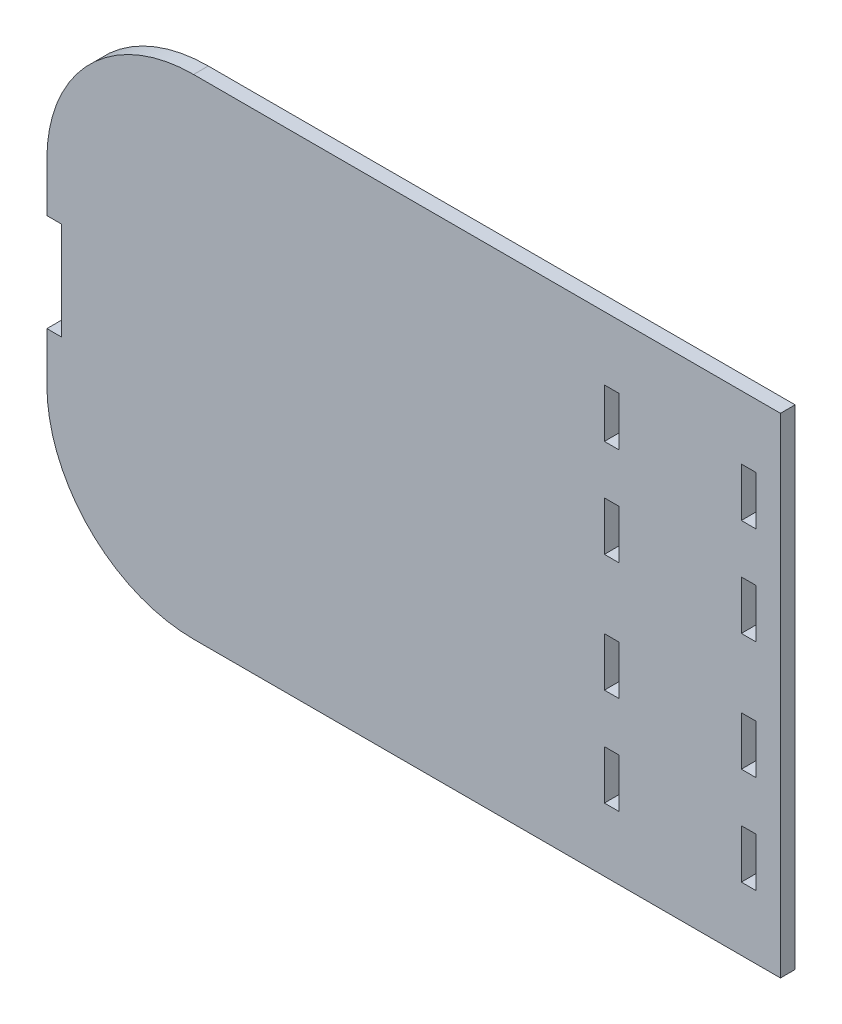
ISO-10303-21;
HEADER;
FILE_DESCRIPTION(('STEP AP214'),'2;1');
FILE_NAME('part.step','',(''),(''),'','','');
FILE_SCHEMA(('AUTOMOTIVE_DESIGN { 1 0 10303 214 1 1 1 1 }'));
ENDSEC;
DATA;
#1=APPLICATION_CONTEXT('core data for automotive mechanical design processes');
#2=APPLICATION_PROTOCOL_DEFINITION('international standard','automotive_design',2000,#1);
#3=PRODUCT_CONTEXT('',#1,'mechanical');
#4=PRODUCT('Part','Part','',(#3));
#5=PRODUCT_RELATED_PRODUCT_CATEGORY('part','',(#4));
#6=PRODUCT_DEFINITION_FORMATION('','',#4);
#7=PRODUCT_DEFINITION_CONTEXT('part definition',#1,'design');
#8=PRODUCT_DEFINITION('design','',#6,#7);
#9=PRODUCT_DEFINITION_SHAPE('','',#8);
#10=(LENGTH_UNIT() NAMED_UNIT(*) SI_UNIT(.MILLI.,.METRE.));
#11=(NAMED_UNIT(*) PLANE_ANGLE_UNIT() SI_UNIT($,.RADIAN.));
#12=(NAMED_UNIT(*) SI_UNIT($,.STERADIAN.) SOLID_ANGLE_UNIT());
#13=UNCERTAINTY_MEASURE_WITH_UNIT(LENGTH_MEASURE(1.E-05),#10,'distance_accuracy_value','');
#14=(GEOMETRIC_REPRESENTATION_CONTEXT(3) GLOBAL_UNCERTAINTY_ASSIGNED_CONTEXT((#13)) GLOBAL_UNIT_ASSIGNED_CONTEXT((#10,
#11,#12)) REPRESENTATION_CONTEXT('',''));
#15=CARTESIAN_POINT('',(0.,0.,0.));
#16=DIRECTION('',(0.,0.,1.));
#17=DIRECTION('',(1.,0.,0.));
#18=AXIS2_PLACEMENT_3D('',#15,#16,#17);
#19=CARTESIAN_POINT('',(-45.,20.,3.));
#20=DIRECTION('',(0.,0.,1.));
#21=DIRECTION('',(1.,0.,0.));
#22=AXIS2_PLACEMENT_3D('',#19,#20,#21);
#23=PLANE('',#22);
#24=DIRECTION('',(0.,1.,0.));
#25=VECTOR('',#24,1.);
#26=CARTESIAN_POINT('',(75.,-50.,3.));
#27=LINE('',#26,#25);
#28=CARTESIAN_POINT('',(75.,-50.,3.));
#29=VERTEX_POINT('',#28);
#30=CARTESIAN_POINT('',(75.,50.,3.));
#31=VERTEX_POINT('',#30);
#32=EDGE_CURVE('E662',#29,#31,#27,.T.);
#33=ORIENTED_EDGE('',*,*,#32,.T.);
#34=DIRECTION('',(-1.,0.,0.));
#35=VECTOR('',#34,1.);
#36=CARTESIAN_POINT('',(75.,50.,3.));
#37=LINE('',#36,#35);
#38=CARTESIAN_POINT('',(-45.,50.,3.));
#39=VERTEX_POINT('',#38);
#40=EDGE_CURVE('E666',#31,#39,#37,.T.);
#41=ORIENTED_EDGE('',*,*,#40,.T.);
#42=CARTESIAN_POINT('',(-45.,20.,3.));
#43=DIRECTION('',(0.,0.,1.));
#44=DIRECTION('',(1.,0.,0.));
#45=AXIS2_PLACEMENT_3D('',#42,#43,#44);
#46=CIRCLE('',#45,30.);
#47=CARTESIAN_POINT('',(-75.,20.,3.));
#48=VERTEX_POINT('',#47);
#49=EDGE_CURVE('E670',#39,#48,#46,.T.);
#50=ORIENTED_EDGE('',*,*,#49,.T.);
#51=DIRECTION('',(0.,-1.,0.));
#52=VECTOR('',#51,1.);
#53=CARTESIAN_POINT('',(-75.,9.9999999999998,3.));
#54=LINE('',#53,#52);
#55=CARTESIAN_POINT('',(-75.,9.9999999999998,3.));
#56=VERTEX_POINT('',#55);
#57=EDGE_CURVE('E673',#48,#56,#54,.T.);
#58=ORIENTED_EDGE('',*,*,#57,.T.);
#59=DIRECTION('',(1.,0.,0.));
#60=VECTOR('',#59,1.);
#61=CARTESIAN_POINT('',(-72.,9.99999999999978,3.));
#62=LINE('',#61,#60);
#63=CARTESIAN_POINT('',(-72.,9.99999999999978,3.));
#64=VERTEX_POINT('',#63);
#65=EDGE_CURVE('E676',#56,#64,#62,.T.);
#66=ORIENTED_EDGE('',*,*,#65,.T.);
#67=DIRECTION('',(0.,-1.,0.));
#68=VECTOR('',#67,1.);
#69=CARTESIAN_POINT('',(-72.,-9.99999999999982,3.));
#70=LINE('',#69,#68);
#71=CARTESIAN_POINT('',(-72.,-9.99999999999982,3.));
#72=VERTEX_POINT('',#71);
#73=EDGE_CURVE('E679',#64,#72,#70,.T.);
#74=ORIENTED_EDGE('',*,*,#73,.T.);
#75=DIRECTION('',(-1.,0.,0.));
#76=VECTOR('',#75,1.);
#77=CARTESIAN_POINT('',(-72.,-9.99999999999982,3.));
#78=LINE('',#77,#76);
#79=CARTESIAN_POINT('',(-75.,-9.99999999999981,3.));
#80=VERTEX_POINT('',#79);
#81=EDGE_CURVE('E682',#72,#80,#78,.T.);
#82=ORIENTED_EDGE('',*,*,#81,.T.);
#83=DIRECTION('',(0.,-1.,0.));
#84=VECTOR('',#83,1.);
#85=CARTESIAN_POINT('',(-75.,-20.,3.));
#86=LINE('',#85,#84);
#87=CARTESIAN_POINT('',(-75.,-20.,3.));
#88=VERTEX_POINT('',#87);
#89=EDGE_CURVE('E685',#80,#88,#86,.T.);
#90=ORIENTED_EDGE('',*,*,#89,.T.);
#91=CARTESIAN_POINT('',(-45.,-20.,3.));
#92=DIRECTION('',(0.,0.,1.));
#93=DIRECTION('',(-1.,0.,0.));
#94=AXIS2_PLACEMENT_3D('',#91,#92,#93);
#95=CIRCLE('',#94,30.);
#96=CARTESIAN_POINT('',(-45.,-50.,3.));
#97=VERTEX_POINT('',#96);
#98=EDGE_CURVE('E688',#88,#97,#95,.T.);
#99=ORIENTED_EDGE('',*,*,#98,.T.);
#100=DIRECTION('',(1.,0.,0.));
#101=VECTOR('',#100,1.);
#102=CARTESIAN_POINT('',(75.,-50.,3.));
#103=LINE('',#102,#101);
#104=EDGE_CURVE('E691',#97,#29,#103,.T.);
#105=ORIENTED_EDGE('',*,*,#104,.T.);
#106=EDGE_LOOP('',(#33,#41,#50,#58,#66,#74,#82,#90,#99,#105));
#107=FACE_BOUND('',#106,.T.);
#108=DIRECTION('',(1.,0.,0.));
#109=VECTOR('',#108,1.);
#110=CARTESIAN_POINT('',(70.0000000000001,27.0200000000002,3.));
#111=LINE('',#110,#109);
#112=CARTESIAN_POINT('',(67.0000000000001,27.0200000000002,3.));
#113=VERTEX_POINT('',#112);
#114=CARTESIAN_POINT('',(70.0000000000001,27.0200000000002,3.));
#115=VERTEX_POINT('',#114);
#116=EDGE_CURVE('E622',#113,#115,#111,.T.);
#117=ORIENTED_EDGE('',*,*,#116,.F.);
#118=DIRECTION('',(0.,-1.,0.));
#119=VECTOR('',#118,1.);
#120=CARTESIAN_POINT('',(67.0000000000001,27.0200000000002,3.));
#121=LINE('',#120,#119);
#122=CARTESIAN_POINT('',(67.0000000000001,37.0200000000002,3.));
#123=VERTEX_POINT('',#122);
#124=EDGE_CURVE('E619',#123,#113,#121,.T.);
#125=ORIENTED_EDGE('',*,*,#124,.F.);
#126=DIRECTION('',(-1.,0.,0.));
#127=VECTOR('',#126,1.);
#128=CARTESIAN_POINT('',(70.0000000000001,37.0200000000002,3.));
#129=LINE('',#128,#127);
#130=CARTESIAN_POINT('',(70.0000000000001,37.0200000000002,3.));
#131=VERTEX_POINT('',#130);
#132=EDGE_CURVE('E630',#131,#123,#129,.T.);
#133=ORIENTED_EDGE('',*,*,#132,.F.);
#134=DIRECTION('',(0.,1.,0.));
#135=VECTOR('',#134,1.);
#136=CARTESIAN_POINT('',(70.0000000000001,27.0200000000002,3.));
#137=LINE('',#136,#135);
#138=EDGE_CURVE('E626',#115,#131,#137,.T.);
#139=ORIENTED_EDGE('',*,*,#138,.F.);
#140=EDGE_LOOP('',(#117,#125,#133,#139));
#141=FACE_BOUND('',#140,.T.);
#142=DIRECTION('',(-1.,0.,0.));
#143=VECTOR('',#142,1.);
#144=CARTESIAN_POINT('',(70.0000000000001,-27.0200000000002,3.));
#145=LINE('',#144,#143);
#146=CARTESIAN_POINT('',(70.0000000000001,-27.0200000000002,3.));
#147=VERTEX_POINT('',#146);
#148=CARTESIAN_POINT('',(67.0000000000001,-27.0200000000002,3.));
#149=VERTEX_POINT('',#148);
#150=EDGE_CURVE('E579',#147,#149,#145,.T.);
#151=ORIENTED_EDGE('',*,*,#150,.F.);
#152=DIRECTION('',(0.,1.,0.));
#153=VECTOR('',#152,1.);
#154=CARTESIAN_POINT('',(70.0000000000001,-27.0200000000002,3.));
#155=LINE('',#154,#153);
#156=CARTESIAN_POINT('',(70.0000000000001,-37.0200000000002,3.));
#157=VERTEX_POINT('',#156);
#158=EDGE_CURVE('E576',#157,#147,#155,.T.);
#159=ORIENTED_EDGE('',*,*,#158,.F.);
#160=DIRECTION('',(1.,0.,0.));
#161=VECTOR('',#160,1.);
#162=CARTESIAN_POINT('',(70.0000000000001,-37.0200000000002,3.));
#163=LINE('',#162,#161);
#164=CARTESIAN_POINT('',(67.0000000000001,-37.0200000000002,3.));
#165=VERTEX_POINT('',#164);
#166=EDGE_CURVE('E587',#165,#157,#163,.T.);
#167=ORIENTED_EDGE('',*,*,#166,.F.);
#168=DIRECTION('',(0.,-1.,0.));
#169=VECTOR('',#168,1.);
#170=CARTESIAN_POINT('',(67.0000000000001,-27.0200000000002,3.));
#171=LINE('',#170,#169);
#172=EDGE_CURVE('E583',#149,#165,#171,.T.);
#173=ORIENTED_EDGE('',*,*,#172,.F.);
#174=EDGE_LOOP('',(#151,#159,#167,#173));
#175=FACE_BOUND('',#174,.T.);
#176=DIRECTION('',(0.,1.,0.));
#177=VECTOR('',#176,1.);
#178=CARTESIAN_POINT('',(70.,-7.01999999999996,3.));
#179=LINE('',#178,#177);
#180=CARTESIAN_POINT('',(70.,-17.02,3.));
#181=VERTEX_POINT('',#180);
#182=CARTESIAN_POINT('',(70.,-7.01999999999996,3.));
#183=VERTEX_POINT('',#182);
#184=EDGE_CURVE('E536',#181,#183,#179,.T.);
#185=ORIENTED_EDGE('',*,*,#184,.F.);
#186=DIRECTION('',(1.,0.,0.));
#187=VECTOR('',#186,1.);
#188=CARTESIAN_POINT('',(70.,-17.02,3.));
#189=LINE('',#188,#187);
#190=CARTESIAN_POINT('',(67.,-17.02,3.));
#191=VERTEX_POINT('',#190);
#192=EDGE_CURVE('E533',#191,#181,#189,.T.);
#193=ORIENTED_EDGE('',*,*,#192,.F.);
#194=DIRECTION('',(0.,-1.,0.));
#195=VECTOR('',#194,1.);
#196=CARTESIAN_POINT('',(67.,-7.02,3.));
#197=LINE('',#196,#195);
#198=CARTESIAN_POINT('',(67.,-7.02,3.));
#199=VERTEX_POINT('',#198);
#200=EDGE_CURVE('E544',#199,#191,#197,.T.);
#201=ORIENTED_EDGE('',*,*,#200,.F.);
#202=DIRECTION('',(-1.,0.,0.));
#203=VECTOR('',#202,1.);
#204=CARTESIAN_POINT('',(70.,-7.01999999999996,3.));
#205=LINE('',#204,#203);
#206=EDGE_CURVE('E540',#183,#199,#205,.T.);
#207=ORIENTED_EDGE('',*,*,#206,.F.);
#208=EDGE_LOOP('',(#185,#193,#201,#207));
#209=FACE_BOUND('',#208,.T.);
#210=DIRECTION('',(0.,-1.,0.));
#211=VECTOR('',#210,1.);
#212=CARTESIAN_POINT('',(67.0000000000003,7.02000000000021,3.));
#213=LINE('',#212,#211);
#214=CARTESIAN_POINT('',(67.0000000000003,17.0200000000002,3.));
#215=VERTEX_POINT('',#214);
#216=CARTESIAN_POINT('',(67.0000000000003,7.02000000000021,3.));
#217=VERTEX_POINT('',#216);
#218=EDGE_CURVE('E493',#215,#217,#213,.T.);
#219=ORIENTED_EDGE('',*,*,#218,.F.);
#220=DIRECTION('',(-1.,0.,0.));
#221=VECTOR('',#220,1.);
#222=CARTESIAN_POINT('',(70.0000000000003,17.02,3.));
#223=LINE('',#222,#221);
#224=CARTESIAN_POINT('',(70.0000000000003,17.02,3.));
#225=VERTEX_POINT('',#224);
#226=EDGE_CURVE('E490',#225,#215,#223,.T.);
#227=ORIENTED_EDGE('',*,*,#226,.F.);
#228=DIRECTION('',(0.,1.,0.));
#229=VECTOR('',#228,1.);
#230=CARTESIAN_POINT('',(70.0000000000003,7.02000000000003,3.));
#231=LINE('',#230,#229);
#232=CARTESIAN_POINT('',(70.0000000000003,7.02000000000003,3.));
#233=VERTEX_POINT('',#232);
#234=EDGE_CURVE('E501',#233,#225,#231,.T.);
#235=ORIENTED_EDGE('',*,*,#234,.F.);
#236=DIRECTION('',(1.,0.,0.));
#237=VECTOR('',#236,1.);
#238=CARTESIAN_POINT('',(70.0000000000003,7.02000000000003,3.));
#239=LINE('',#238,#237);
#240=EDGE_CURVE('E497',#217,#233,#239,.T.);
#241=ORIENTED_EDGE('',*,*,#240,.F.);
#242=EDGE_LOOP('',(#219,#227,#235,#241));
#243=FACE_BOUND('',#242,.T.);
#244=DIRECTION('',(0.,-1.,0.));
#245=VECTOR('',#244,1.);
#246=CARTESIAN_POINT('',(39.0000000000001,27.02,3.));
#247=LINE('',#246,#245);
#248=CARTESIAN_POINT('',(39.0000000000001,37.02,3.));
#249=VERTEX_POINT('',#248);
#250=CARTESIAN_POINT('',(39.0000000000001,27.02,3.));
#251=VERTEX_POINT('',#250);
#252=EDGE_CURVE('E450',#249,#251,#247,.T.);
#253=ORIENTED_EDGE('',*,*,#252,.F.);
#254=DIRECTION('',(-1.,0.,0.));
#255=VECTOR('',#254,1.);
#256=CARTESIAN_POINT('',(42.0000000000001,37.02,3.));
#257=LINE('',#256,#255);
#258=CARTESIAN_POINT('',(42.0000000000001,37.02,3.));
#259=VERTEX_POINT('',#258);
#260=EDGE_CURVE('E447',#259,#249,#257,.T.);
#261=ORIENTED_EDGE('',*,*,#260,.F.);
#262=DIRECTION('',(0.,1.,0.));
#263=VECTOR('',#262,1.);
#264=CARTESIAN_POINT('',(42.0000000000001,27.02,3.));
#265=LINE('',#264,#263);
#266=CARTESIAN_POINT('',(42.0000000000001,27.02,3.));
#267=VERTEX_POINT('',#266);
#268=EDGE_CURVE('E458',#267,#259,#265,.T.);
#269=ORIENTED_EDGE('',*,*,#268,.F.);
#270=DIRECTION('',(1.,0.,0.));
#271=VECTOR('',#270,1.);
#272=CARTESIAN_POINT('',(42.0000000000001,27.02,3.));
#273=LINE('',#272,#271);
#274=EDGE_CURVE('E454',#251,#267,#273,.T.);
#275=ORIENTED_EDGE('',*,*,#274,.F.);
#276=EDGE_LOOP('',(#253,#261,#269,#275));
#277=FACE_BOUND('',#276,.T.);
#278=DIRECTION('',(0.,1.,0.));
#279=VECTOR('',#278,1.);
#280=CARTESIAN_POINT('',(42.0000000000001,-27.0200000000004,3.));
#281=LINE('',#280,#279);
#282=CARTESIAN_POINT('',(42.0000000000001,-37.0200000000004,3.));
#283=VERTEX_POINT('',#282);
#284=CARTESIAN_POINT('',(42.0000000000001,-27.0200000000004,3.));
#285=VERTEX_POINT('',#284);
#286=EDGE_CURVE('E407',#283,#285,#281,.T.);
#287=ORIENTED_EDGE('',*,*,#286,.F.);
#288=DIRECTION('',(1.,0.,0.));
#289=VECTOR('',#288,1.);
#290=CARTESIAN_POINT('',(42.0000000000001,-37.0200000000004,3.));
#291=LINE('',#290,#289);
#292=CARTESIAN_POINT('',(39.0000000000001,-37.0200000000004,3.));
#293=VERTEX_POINT('',#292);
#294=EDGE_CURVE('E404',#293,#283,#291,.T.);
#295=ORIENTED_EDGE('',*,*,#294,.F.);
#296=DIRECTION('',(0.,-1.,0.));
#297=VECTOR('',#296,1.);
#298=CARTESIAN_POINT('',(39.0000000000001,-27.0200000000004,3.));
#299=LINE('',#298,#297);
#300=CARTESIAN_POINT('',(39.0000000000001,-27.0200000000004,3.));
#301=VERTEX_POINT('',#300);
#302=EDGE_CURVE('E415',#301,#293,#299,.T.);
#303=ORIENTED_EDGE('',*,*,#302,.F.);
#304=DIRECTION('',(-1.,0.,0.));
#305=VECTOR('',#304,1.);
#306=CARTESIAN_POINT('',(42.0000000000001,-27.0200000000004,3.));
#307=LINE('',#306,#305);
#308=EDGE_CURVE('E411',#285,#301,#307,.T.);
#309=ORIENTED_EDGE('',*,*,#308,.F.);
#310=EDGE_LOOP('',(#287,#295,#303,#309));
#311=FACE_BOUND('',#310,.T.);
#312=DIRECTION('',(0.,1.,0.));
#313=VECTOR('',#312,1.);
#314=CARTESIAN_POINT('',(42.,-7.02000000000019,3.));
#315=LINE('',#314,#313);
#316=CARTESIAN_POINT('',(42.,-17.0200000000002,3.));
#317=VERTEX_POINT('',#316);
#318=CARTESIAN_POINT('',(42.,-7.02000000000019,3.));
#319=VERTEX_POINT('',#318);
#320=EDGE_CURVE('E364',#317,#319,#315,.T.);
#321=ORIENTED_EDGE('',*,*,#320,.F.);
#322=DIRECTION('',(1.,0.,0.));
#323=VECTOR('',#322,1.);
#324=CARTESIAN_POINT('',(42.,-17.0200000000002,3.));
#325=LINE('',#324,#323);
#326=CARTESIAN_POINT('',(39.,-17.0200000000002,3.));
#327=VERTEX_POINT('',#326);
#328=EDGE_CURVE('E361',#327,#317,#325,.T.);
#329=ORIENTED_EDGE('',*,*,#328,.F.);
#330=DIRECTION('',(0.,-1.,0.));
#331=VECTOR('',#330,1.);
#332=CARTESIAN_POINT('',(39.,-7.02000000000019,3.));
#333=LINE('',#332,#331);
#334=CARTESIAN_POINT('',(39.,-7.0200000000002,3.));
#335=VERTEX_POINT('',#334);
#336=EDGE_CURVE('E372',#335,#327,#333,.T.);
#337=ORIENTED_EDGE('',*,*,#336,.F.);
#338=DIRECTION('',(-1.,0.,0.));
#339=VECTOR('',#338,1.);
#340=CARTESIAN_POINT('',(42.,-7.02000000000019,3.));
#341=LINE('',#340,#339);
#342=EDGE_CURVE('E368',#319,#335,#341,.T.);
#343=ORIENTED_EDGE('',*,*,#342,.F.);
#344=EDGE_LOOP('',(#321,#329,#337,#343));
#345=FACE_BOUND('',#344,.T.);
#346=DIRECTION('',(0.,-1.,0.));
#347=VECTOR('',#346,1.);
#348=CARTESIAN_POINT('',(39.0000000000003,7.02000000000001,3.));
#349=LINE('',#348,#347);
#350=CARTESIAN_POINT('',(39.0000000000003,17.02,3.));
#351=VERTEX_POINT('',#350);
#352=CARTESIAN_POINT('',(39.0000000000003,7.02000000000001,3.));
#353=VERTEX_POINT('',#352);
#354=EDGE_CURVE('E322',#351,#353,#349,.T.);
#355=ORIENTED_EDGE('',*,*,#354,.F.);
#356=DIRECTION('',(-1.,0.,0.));
#357=VECTOR('',#356,1.);
#358=CARTESIAN_POINT('',(42.0000000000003,17.02,3.));
#359=LINE('',#358,#357);
#360=CARTESIAN_POINT('',(42.0000000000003,17.02,3.));
#361=VERTEX_POINT('',#360);
#362=EDGE_CURVE('E313',#361,#351,#359,.T.);
#363=ORIENTED_EDGE('',*,*,#362,.F.);
#364=DIRECTION('',(0.,1.,0.));
#365=VECTOR('',#364,1.);
#366=CARTESIAN_POINT('',(42.0000000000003,7.02000000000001,3.));
#367=LINE('',#366,#365);
#368=CARTESIAN_POINT('',(42.0000000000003,7.02000000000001,3.));
#369=VERTEX_POINT('',#368);
#370=EDGE_CURVE('E339',#369,#361,#367,.T.);
#371=ORIENTED_EDGE('',*,*,#370,.F.);
#372=DIRECTION('',(1.,0.,0.));
#373=VECTOR('',#372,1.);
#374=CARTESIAN_POINT('',(42.0000000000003,7.02000000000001,3.));
#375=LINE('',#374,#373);
#376=EDGE_CURVE('E335',#353,#369,#375,.T.);
#377=ORIENTED_EDGE('',*,*,#376,.F.);
#378=EDGE_LOOP('',(#355,#363,#371,#377));
#379=FACE_BOUND('',#378,.T.);
#380=ADVANCED_FACE('F43',(#107,#141,#175,#209,#243,#277,#311,#345,#379),#23,.T.);
#381=CARTESIAN_POINT('',(-45.,20.,0.));
#382=DIRECTION('',(0.,0.,1.));
#383=DIRECTION('',(1.,0.,0.));
#384=AXIS2_PLACEMENT_3D('',#381,#382,#383);
#385=PLANE('',#384);
#386=DIRECTION('',(1.,0.,0.));
#387=VECTOR('',#386,1.);
#388=CARTESIAN_POINT('',(42.,-17.0200000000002,0.));
#389=LINE('',#388,#387);
#390=CARTESIAN_POINT('',(39.,-17.0200000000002,0.));
#391=VERTEX_POINT('',#390);
#392=CARTESIAN_POINT('',(42.,-17.0200000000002,0.));
#393=VERTEX_POINT('',#392);
#394=EDGE_CURVE('E331',#391,#393,#389,.T.);
#395=ORIENTED_EDGE('',*,*,#394,.T.);
#396=DIRECTION('',(0.,1.,0.));
#397=VECTOR('',#396,1.);
#398=CARTESIAN_POINT('',(42.,-7.02000000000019,0.));
#399=LINE('',#398,#397);
#400=CARTESIAN_POINT('',(42.,-7.02000000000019,0.));
#401=VERTEX_POINT('',#400);
#402=EDGE_CURVE('E379',#393,#401,#399,.T.);
#403=ORIENTED_EDGE('',*,*,#402,.T.);
#404=DIRECTION('',(-1.,0.,0.));
#405=VECTOR('',#404,1.);
#406=CARTESIAN_POINT('',(42.,-7.02000000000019,0.));
#407=LINE('',#406,#405);
#408=CARTESIAN_POINT('',(39.,-7.02000000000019,0.));
#409=VERTEX_POINT('',#408);
#410=EDGE_CURVE('E383',#401,#409,#407,.T.);
#411=ORIENTED_EDGE('',*,*,#410,.T.);
#412=DIRECTION('',(0.,-1.,0.));
#413=VECTOR('',#412,1.);
#414=CARTESIAN_POINT('',(39.,-7.02000000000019,0.));
#415=LINE('',#414,#413);
#416=EDGE_CURVE('E365',#409,#391,#415,.T.);
#417=ORIENTED_EDGE('',*,*,#416,.T.);
#418=EDGE_LOOP('',(#395,#403,#411,#417));
#419=FACE_BOUND('',#418,.T.);
#420=DIRECTION('',(-1.,0.,0.));
#421=VECTOR('',#420,1.);
#422=CARTESIAN_POINT('',(42.0000000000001,37.02,0.));
#423=LINE('',#422,#421);
#424=CARTESIAN_POINT('',(42.0000000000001,37.02,0.));
#425=VERTEX_POINT('',#424);
#426=CARTESIAN_POINT('',(39.0000000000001,37.02,0.));
#427=VERTEX_POINT('',#426);
#428=EDGE_CURVE('E446',#425,#427,#423,.T.);
#429=ORIENTED_EDGE('',*,*,#428,.T.);
#430=DIRECTION('',(0.,-1.,0.));
#431=VECTOR('',#430,1.);
#432=CARTESIAN_POINT('',(39.0000000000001,27.02,0.));
#433=LINE('',#432,#431);
#434=CARTESIAN_POINT('',(39.0000000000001,27.02,0.));
#435=VERTEX_POINT('',#434);
#436=EDGE_CURVE('E465',#427,#435,#433,.T.);
#437=ORIENTED_EDGE('',*,*,#436,.T.);
#438=DIRECTION('',(1.,0.,0.));
#439=VECTOR('',#438,1.);
#440=CARTESIAN_POINT('',(42.0000000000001,27.02,0.));
#441=LINE('',#440,#439);
#442=CARTESIAN_POINT('',(42.0000000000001,27.02,0.));
#443=VERTEX_POINT('',#442);
#444=EDGE_CURVE('E469',#435,#443,#441,.T.);
#445=ORIENTED_EDGE('',*,*,#444,.T.);
#446=DIRECTION('',(0.,1.,0.));
#447=VECTOR('',#446,1.);
#448=CARTESIAN_POINT('',(42.0000000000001,27.02,0.));
#449=LINE('',#448,#447);
#450=EDGE_CURVE('E451',#443,#425,#449,.T.);
#451=ORIENTED_EDGE('',*,*,#450,.T.);
#452=EDGE_LOOP('',(#429,#437,#445,#451));
#453=FACE_BOUND('',#452,.T.);
#454=DIRECTION('',(1.,0.,0.));
#455=VECTOR('',#454,1.);
#456=CARTESIAN_POINT('',(70.,-17.02,0.));
#457=LINE('',#456,#455);
#458=CARTESIAN_POINT('',(67.,-17.02,0.));
#459=VERTEX_POINT('',#458);
#460=CARTESIAN_POINT('',(70.,-17.02,0.));
#461=VERTEX_POINT('',#460);
#462=EDGE_CURVE('E532',#459,#461,#457,.T.);
#463=ORIENTED_EDGE('',*,*,#462,.T.);
#464=DIRECTION('',(0.,1.,0.));
#465=VECTOR('',#464,1.);
#466=CARTESIAN_POINT('',(70.,-7.01999999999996,0.));
#467=LINE('',#466,#465);
#468=CARTESIAN_POINT('',(70.,-7.01999999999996,0.));
#469=VERTEX_POINT('',#468);
#470=EDGE_CURVE('E551',#461,#469,#467,.T.);
#471=ORIENTED_EDGE('',*,*,#470,.T.);
#472=DIRECTION('',(-1.,0.,0.));
#473=VECTOR('',#472,1.);
#474=CARTESIAN_POINT('',(70.,-7.01999999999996,0.));
#475=LINE('',#474,#473);
#476=CARTESIAN_POINT('',(67.,-7.02,0.));
#477=VERTEX_POINT('',#476);
#478=EDGE_CURVE('E555',#469,#477,#475,.T.);
#479=ORIENTED_EDGE('',*,*,#478,.T.);
#480=DIRECTION('',(0.,-1.,0.));
#481=VECTOR('',#480,1.);
#482=CARTESIAN_POINT('',(67.,-7.02,0.));
#483=LINE('',#482,#481);
#484=EDGE_CURVE('E537',#477,#459,#483,.T.);
#485=ORIENTED_EDGE('',*,*,#484,.T.);
#486=EDGE_LOOP('',(#463,#471,#479,#485));
#487=FACE_BOUND('',#486,.T.);
#488=DIRECTION('',(0.,-1.,0.));
#489=VECTOR('',#488,1.);
#490=CARTESIAN_POINT('',(67.0000000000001,27.0200000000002,0.));
#491=LINE('',#490,#489);
#492=CARTESIAN_POINT('',(67.0000000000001,37.0200000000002,0.));
#493=VERTEX_POINT('',#492);
#494=CARTESIAN_POINT('',(67.0000000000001,27.0200000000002,0.));
#495=VERTEX_POINT('',#494);
#496=EDGE_CURVE('E618',#493,#495,#491,.T.);
#497=ORIENTED_EDGE('',*,*,#496,.T.);
#498=DIRECTION('',(1.,0.,0.));
#499=VECTOR('',#498,1.);
#500=CARTESIAN_POINT('',(70.0000000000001,27.0200000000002,0.));
#501=LINE('',#500,#499);
#502=CARTESIAN_POINT('',(70.0000000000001,27.0200000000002,0.));
#503=VERTEX_POINT('',#502);
#504=EDGE_CURVE('E637',#495,#503,#501,.T.);
#505=ORIENTED_EDGE('',*,*,#504,.T.);
#506=DIRECTION('',(0.,1.,0.));
#507=VECTOR('',#506,1.);
#508=CARTESIAN_POINT('',(70.0000000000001,27.0200000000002,0.));
#509=LINE('',#508,#507);
#510=CARTESIAN_POINT('',(70.0000000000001,37.0200000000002,0.));
#511=VERTEX_POINT('',#510);
#512=EDGE_CURVE('E641',#503,#511,#509,.T.);
#513=ORIENTED_EDGE('',*,*,#512,.T.);
#514=DIRECTION('',(-1.,0.,0.));
#515=VECTOR('',#514,1.);
#516=CARTESIAN_POINT('',(70.0000000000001,37.0200000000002,0.));
#517=LINE('',#516,#515);
#518=EDGE_CURVE('E623',#511,#493,#517,.T.);
#519=ORIENTED_EDGE('',*,*,#518,.T.);
#520=EDGE_LOOP('',(#497,#505,#513,#519));
#521=FACE_BOUND('',#520,.T.);
#522=DIRECTION('',(0.,1.,0.));
#523=VECTOR('',#522,1.);
#524=CARTESIAN_POINT('',(75.,-50.,0.));
#525=LINE('',#524,#523);
#526=CARTESIAN_POINT('',(75.,-50.,0.));
#527=VERTEX_POINT('',#526);
#528=CARTESIAN_POINT('',(75.,50.,0.));
#529=VERTEX_POINT('',#528);
#530=EDGE_CURVE('E661',#527,#529,#525,.T.);
#531=ORIENTED_EDGE('',*,*,#530,.F.);
#532=DIRECTION('',(1.,0.,0.));
#533=VECTOR('',#532,1.);
#534=CARTESIAN_POINT('',(75.,-50.,0.));
#535=LINE('',#534,#533);
#536=CARTESIAN_POINT('',(-45.,-50.,0.));
#537=VERTEX_POINT('',#536);
#538=EDGE_CURVE('E667',#537,#527,#535,.T.);
#539=ORIENTED_EDGE('',*,*,#538,.F.);
#540=CARTESIAN_POINT('',(-45.,-20.,0.));
#541=DIRECTION('',(0.,0.,1.));
#542=DIRECTION('',(-1.,0.,0.));
#543=AXIS2_PLACEMENT_3D('',#540,#541,#542);
#544=CIRCLE('',#543,30.);
#545=CARTESIAN_POINT('',(-75.,-20.,0.));
#546=VERTEX_POINT('',#545);
#547=EDGE_CURVE('E719',#546,#537,#544,.T.);
#548=ORIENTED_EDGE('',*,*,#547,.F.);
#549=DIRECTION('',(0.,-1.,0.));
#550=VECTOR('',#549,1.);
#551=CARTESIAN_POINT('',(-75.,-20.,0.));
#552=LINE('',#551,#550);
#553=CARTESIAN_POINT('',(-75.,-9.99999999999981,0.));
#554=VERTEX_POINT('',#553);
#555=EDGE_CURVE('E716',#554,#546,#552,.T.);
#556=ORIENTED_EDGE('',*,*,#555,.F.);
#557=DIRECTION('',(-1.,0.,0.));
#558=VECTOR('',#557,1.);
#559=CARTESIAN_POINT('',(-72.,-9.99999999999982,0.));
#560=LINE('',#559,#558);
#561=CARTESIAN_POINT('',(-72.,-9.99999999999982,0.));
#562=VERTEX_POINT('',#561);
#563=EDGE_CURVE('E713',#562,#554,#560,.T.);
#564=ORIENTED_EDGE('',*,*,#563,.F.);
#565=DIRECTION('',(0.,-1.,0.));
#566=VECTOR('',#565,1.);
#567=CARTESIAN_POINT('',(-72.,-9.99999999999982,0.));
#568=LINE('',#567,#566);
#569=CARTESIAN_POINT('',(-72.,9.99999999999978,0.));
#570=VERTEX_POINT('',#569);
#571=EDGE_CURVE('E710',#570,#562,#568,.T.);
#572=ORIENTED_EDGE('',*,*,#571,.F.);
#573=DIRECTION('',(1.,0.,0.));
#574=VECTOR('',#573,1.);
#575=CARTESIAN_POINT('',(-72.,9.99999999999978,0.));
#576=LINE('',#575,#574);
#577=CARTESIAN_POINT('',(-75.,9.9999999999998,0.));
#578=VERTEX_POINT('',#577);
#579=EDGE_CURVE('E707',#578,#570,#576,.T.);
#580=ORIENTED_EDGE('',*,*,#579,.F.);
#581=DIRECTION('',(0.,-1.,0.));
#582=VECTOR('',#581,1.);
#583=CARTESIAN_POINT('',(-75.,9.9999999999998,0.));
#584=LINE('',#583,#582);
#585=CARTESIAN_POINT('',(-75.,20.,0.));
#586=VERTEX_POINT('',#585);
#587=EDGE_CURVE('E704',#586,#578,#584,.T.);
#588=ORIENTED_EDGE('',*,*,#587,.F.);
#589=CARTESIAN_POINT('',(-45.,20.,0.));
#590=DIRECTION('',(0.,0.,1.));
#591=DIRECTION('',(1.,0.,0.));
#592=AXIS2_PLACEMENT_3D('',#589,#590,#591);
#593=CIRCLE('',#592,30.);
#594=CARTESIAN_POINT('',(-45.,50.,0.));
#595=VERTEX_POINT('',#594);
#596=EDGE_CURVE('E701',#595,#586,#593,.T.);
#597=ORIENTED_EDGE('',*,*,#596,.F.);
#598=DIRECTION('',(-1.,0.,0.));
#599=VECTOR('',#598,1.);
#600=CARTESIAN_POINT('',(75.,50.,0.));
#601=LINE('',#600,#599);
#602=EDGE_CURVE('E698',#529,#595,#601,.T.);
#603=ORIENTED_EDGE('',*,*,#602,.F.);
#604=EDGE_LOOP('',(#531,#539,#548,#556,#564,#572,#580,#588,#597,#603));
#605=FACE_BOUND('',#604,.T.);
#606=DIRECTION('',(0.,1.,0.));
#607=VECTOR('',#606,1.);
#608=CARTESIAN_POINT('',(70.0000000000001,-27.0200000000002,0.));
#609=LINE('',#608,#607);
#610=CARTESIAN_POINT('',(70.0000000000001,-37.0200000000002,0.));
#611=VERTEX_POINT('',#610);
#612=CARTESIAN_POINT('',(70.0000000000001,-27.0200000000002,0.));
#613=VERTEX_POINT('',#612);
#614=EDGE_CURVE('E575',#611,#613,#609,.T.);
#615=ORIENTED_EDGE('',*,*,#614,.T.);
#616=DIRECTION('',(-1.,0.,0.));
#617=VECTOR('',#616,1.);
#618=CARTESIAN_POINT('',(70.0000000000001,-27.0200000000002,0.));
#619=LINE('',#618,#617);
#620=CARTESIAN_POINT('',(67.0000000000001,-27.0200000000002,0.));
#621=VERTEX_POINT('',#620);
#622=EDGE_CURVE('E594',#613,#621,#619,.T.);
#623=ORIENTED_EDGE('',*,*,#622,.T.);
#624=DIRECTION('',(0.,-1.,0.));
#625=VECTOR('',#624,1.);
#626=CARTESIAN_POINT('',(67.0000000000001,-27.0200000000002,0.));
#627=LINE('',#626,#625);
#628=CARTESIAN_POINT('',(67.0000000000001,-37.0200000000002,0.));
#629=VERTEX_POINT('',#628);
#630=EDGE_CURVE('E598',#621,#629,#627,.T.);
#631=ORIENTED_EDGE('',*,*,#630,.T.);
#632=DIRECTION('',(1.,0.,0.));
#633=VECTOR('',#632,1.);
#634=CARTESIAN_POINT('',(70.0000000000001,-37.0200000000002,0.));
#635=LINE('',#634,#633);
#636=EDGE_CURVE('E580',#629,#611,#635,.T.);
#637=ORIENTED_EDGE('',*,*,#636,.T.);
#638=EDGE_LOOP('',(#615,#623,#631,#637));
#639=FACE_BOUND('',#638,.T.);
#640=DIRECTION('',(-1.,0.,0.));
#641=VECTOR('',#640,1.);
#642=CARTESIAN_POINT('',(70.0000000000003,17.02,0.));
#643=LINE('',#642,#641);
#644=CARTESIAN_POINT('',(70.0000000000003,17.02,0.));
#645=VERTEX_POINT('',#644);
#646=CARTESIAN_POINT('',(67.0000000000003,17.0200000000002,0.));
#647=VERTEX_POINT('',#646);
#648=EDGE_CURVE('E489',#645,#647,#643,.T.);
#649=ORIENTED_EDGE('',*,*,#648,.T.);
#650=DIRECTION('',(0.,-1.,0.));
#651=VECTOR('',#650,1.);
#652=CARTESIAN_POINT('',(67.0000000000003,7.02000000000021,0.));
#653=LINE('',#652,#651);
#654=CARTESIAN_POINT('',(67.0000000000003,7.02000000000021,0.));
#655=VERTEX_POINT('',#654);
#656=EDGE_CURVE('E508',#647,#655,#653,.T.);
#657=ORIENTED_EDGE('',*,*,#656,.T.);
#658=DIRECTION('',(1.,0.,0.));
#659=VECTOR('',#658,1.);
#660=CARTESIAN_POINT('',(70.0000000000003,7.02000000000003,0.));
#661=LINE('',#660,#659);
#662=CARTESIAN_POINT('',(70.0000000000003,7.02000000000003,0.));
#663=VERTEX_POINT('',#662);
#664=EDGE_CURVE('E512',#655,#663,#661,.T.);
#665=ORIENTED_EDGE('',*,*,#664,.T.);
#666=DIRECTION('',(0.,1.,0.));
#667=VECTOR('',#666,1.);
#668=CARTESIAN_POINT('',(70.0000000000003,7.02000000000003,0.));
#669=LINE('',#668,#667);
#670=EDGE_CURVE('E494',#663,#645,#669,.T.);
#671=ORIENTED_EDGE('',*,*,#670,.T.);
#672=EDGE_LOOP('',(#649,#657,#665,#671));
#673=FACE_BOUND('',#672,.T.);
#674=DIRECTION('',(1.,0.,0.));
#675=VECTOR('',#674,1.);
#676=CARTESIAN_POINT('',(42.0000000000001,-37.0200000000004,0.));
#677=LINE('',#676,#675);
#678=CARTESIAN_POINT('',(39.0000000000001,-37.0200000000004,0.));
#679=VERTEX_POINT('',#678);
#680=CARTESIAN_POINT('',(42.0000000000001,-37.0200000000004,0.));
#681=VERTEX_POINT('',#680);
#682=EDGE_CURVE('E403',#679,#681,#677,.T.);
#683=ORIENTED_EDGE('',*,*,#682,.T.);
#684=DIRECTION('',(0.,1.,0.));
#685=VECTOR('',#684,1.);
#686=CARTESIAN_POINT('',(42.0000000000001,-27.0200000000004,0.));
#687=LINE('',#686,#685);
#688=CARTESIAN_POINT('',(42.0000000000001,-27.0200000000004,0.));
#689=VERTEX_POINT('',#688);
#690=EDGE_CURVE('E422',#681,#689,#687,.T.);
#691=ORIENTED_EDGE('',*,*,#690,.T.);
#692=DIRECTION('',(-1.,0.,0.));
#693=VECTOR('',#692,1.);
#694=CARTESIAN_POINT('',(42.0000000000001,-27.0200000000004,0.));
#695=LINE('',#694,#693);
#696=CARTESIAN_POINT('',(39.0000000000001,-27.0200000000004,0.));
#697=VERTEX_POINT('',#696);
#698=EDGE_CURVE('E426',#689,#697,#695,.T.);
#699=ORIENTED_EDGE('',*,*,#698,.T.);
#700=DIRECTION('',(0.,-1.,0.));
#701=VECTOR('',#700,1.);
#702=CARTESIAN_POINT('',(39.0000000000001,-27.0200000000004,0.));
#703=LINE('',#702,#701);
#704=EDGE_CURVE('E408',#697,#679,#703,.T.);
#705=ORIENTED_EDGE('',*,*,#704,.T.);
#706=EDGE_LOOP('',(#683,#691,#699,#705));
#707=FACE_BOUND('',#706,.T.);
#708=DIRECTION('',(-1.,0.,0.));
#709=VECTOR('',#708,1.);
#710=CARTESIAN_POINT('',(42.0000000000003,17.02,0.));
#711=LINE('',#710,#709);
#712=CARTESIAN_POINT('',(42.0000000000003,17.02,0.));
#713=VERTEX_POINT('',#712);
#714=CARTESIAN_POINT('',(39.0000000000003,17.02,0.));
#715=VERTEX_POINT('',#714);
#716=EDGE_CURVE('E67',#713,#715,#711,.T.);
#717=ORIENTED_EDGE('',*,*,#716,.T.);
#718=DIRECTION('',(0.,-1.,0.));
#719=VECTOR('',#718,1.);
#720=CARTESIAN_POINT('',(39.0000000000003,7.02000000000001,0.));
#721=LINE('',#720,#719);
#722=CARTESIAN_POINT('',(39.0000000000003,7.02000000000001,0.));
#723=VERTEX_POINT('',#722);
#724=EDGE_CURVE('E329',#715,#723,#721,.T.);
#725=ORIENTED_EDGE('',*,*,#724,.T.);
#726=DIRECTION('',(1.,0.,0.));
#727=VECTOR('',#726,1.);
#728=CARTESIAN_POINT('',(42.0000000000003,7.02000000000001,0.));
#729=LINE('',#728,#727);
#730=CARTESIAN_POINT('',(42.0000000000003,7.02000000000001,0.));
#731=VERTEX_POINT('',#730);
#732=EDGE_CURVE('E348',#723,#731,#729,.T.);
#733=ORIENTED_EDGE('',*,*,#732,.T.);
#734=DIRECTION('',(0.,1.,0.));
#735=VECTOR('',#734,1.);
#736=CARTESIAN_POINT('',(42.0000000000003,7.02000000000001,0.));
#737=LINE('',#736,#735);
#738=EDGE_CURVE('E323',#731,#713,#737,.T.);
#739=ORIENTED_EDGE('',*,*,#738,.T.);
#740=EDGE_LOOP('',(#717,#725,#733,#739));
#741=FACE_BOUND('',#740,.T.);
#742=ADVANCED_FACE('F766',(#419,#453,#487,#521,#605,#639,#673,#707,#741),#385,.F.);
#743=CARTESIAN_POINT('',(75.,-50.,3.));
#744=DIRECTION('',(-1.,0.,0.));
#745=DIRECTION('',(0.,-1.,0.));
#746=AXIS2_PLACEMENT_3D('',#743,#744,#745);
#747=PLANE('',#746);
#748=ORIENTED_EDGE('',*,*,#530,.T.);
#749=DIRECTION('',(0.,0.,-1.));
#750=VECTOR('',#749,1.);
#751=CARTESIAN_POINT('',(75.,50.,3.));
#752=LINE('',#751,#750);
#753=EDGE_CURVE('E11',#31,#529,#752,.T.);
#754=ORIENTED_EDGE('',*,*,#753,.F.);
#755=ORIENTED_EDGE('',*,*,#32,.F.);
#756=DIRECTION('',(0.,0.,-1.));
#757=VECTOR('',#756,1.);
#758=CARTESIAN_POINT('',(75.,-50.,3.));
#759=LINE('',#758,#757);
#760=EDGE_CURVE('E694',#29,#527,#759,.T.);
#761=ORIENTED_EDGE('',*,*,#760,.T.);
#762=EDGE_LOOP('',(#748,#754,#755,#761));
#763=FACE_BOUND('',#762,.T.);
#764=ADVANCED_FACE('F45',(#763),#747,.F.);
#765=CARTESIAN_POINT('',(75.,50.,3.));
#766=DIRECTION('',(0.,-1.,0.));
#767=DIRECTION('',(1.,0.,0.));
#768=AXIS2_PLACEMENT_3D('',#765,#766,#767);
#769=PLANE('',#768);
#770=ORIENTED_EDGE('',*,*,#602,.T.);
#771=DIRECTION('',(0.,0.,-1.));
#772=VECTOR('',#771,1.);
#773=CARTESIAN_POINT('',(-45.,50.,3.));
#774=LINE('',#773,#772);
#775=EDGE_CURVE('E52',#39,#595,#774,.T.);
#776=ORIENTED_EDGE('',*,*,#775,.F.);
#777=ORIENTED_EDGE('',*,*,#40,.F.);
#778=ORIENTED_EDGE('',*,*,#753,.T.);
#779=EDGE_LOOP('',(#770,#776,#777,#778));
#780=FACE_BOUND('',#779,.T.);
#781=ADVANCED_FACE('F784',(#780),#769,.F.);
#782=CARTESIAN_POINT('',(-45.,20.,3.));
#783=DIRECTION('',(0.,0.,-1.));
#784=DIRECTION('',(-1.,0.,0.));
#785=AXIS2_PLACEMENT_3D('',#782,#783,#784);
#786=CYLINDRICAL_SURFACE('',#785,30.);
#787=ORIENTED_EDGE('',*,*,#596,.T.);
#788=DIRECTION('',(0.,0.,-1.));
#789=VECTOR('',#788,1.);
#790=CARTESIAN_POINT('',(-75.,20.,3.));
#791=LINE('',#790,#789);
#792=EDGE_CURVE('E751',#48,#586,#791,.T.);
#793=ORIENTED_EDGE('',*,*,#792,.F.);
#794=ORIENTED_EDGE('',*,*,#49,.F.);
#795=ORIENTED_EDGE('',*,*,#775,.T.);
#796=EDGE_LOOP('',(#787,#793,#794,#795));
#797=FACE_BOUND('',#796,.T.);
#798=ADVANCED_FACE('F760',(#797),#786,.T.);
#799=CARTESIAN_POINT('',(-75.,9.9999999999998,3.));
#800=DIRECTION('',(1.,0.,0.));
#801=DIRECTION('',(0.,0.,-1.));
#802=AXIS2_PLACEMENT_3D('',#799,#800,#801);
#803=PLANE('',#802);
#804=ORIENTED_EDGE('',*,*,#587,.T.);
#805=DIRECTION('',(0.,0.,-1.));
#806=VECTOR('',#805,1.);
#807=CARTESIAN_POINT('',(-75.,9.9999999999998,3.));
#808=LINE('',#807,#806);
#809=EDGE_CURVE('E747',#56,#578,#808,.T.);
#810=ORIENTED_EDGE('',*,*,#809,.F.);
#811=ORIENTED_EDGE('',*,*,#57,.F.);
#812=ORIENTED_EDGE('',*,*,#792,.T.);
#813=EDGE_LOOP('',(#804,#810,#811,#812));
#814=FACE_BOUND('',#813,.T.);
#815=ADVANCED_FACE('F772',(#814),#803,.F.);
#816=CARTESIAN_POINT('',(-72.,9.99999999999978,3.));
#817=DIRECTION('',(0.,1.,0.));
#818=DIRECTION('',(-1.,0.,0.));
#819=AXIS2_PLACEMENT_3D('',#816,#817,#818);
#820=PLANE('',#819);
#821=ORIENTED_EDGE('',*,*,#579,.T.);
#822=DIRECTION('',(0.,0.,-1.));
#823=VECTOR('',#822,1.);
#824=CARTESIAN_POINT('',(-72.,9.99999999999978,3.));
#825=LINE('',#824,#823);
#826=EDGE_CURVE('E743',#64,#570,#825,.T.);
#827=ORIENTED_EDGE('',*,*,#826,.F.);
#828=ORIENTED_EDGE('',*,*,#65,.F.);
#829=ORIENTED_EDGE('',*,*,#809,.T.);
#830=EDGE_LOOP('',(#821,#827,#828,#829));
#831=FACE_BOUND('',#830,.T.);
#832=ADVANCED_FACE('F776',(#831),#820,.F.);
#833=CARTESIAN_POINT('',(-72.,-9.99999999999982,3.));
#834=DIRECTION('',(1.,0.,0.));
#835=DIRECTION('',(0.,0.,-1.));
#836=AXIS2_PLACEMENT_3D('',#833,#834,#835);
#837=PLANE('',#836);
#838=ORIENTED_EDGE('',*,*,#571,.T.);
#839=DIRECTION('',(0.,0.,-1.));
#840=VECTOR('',#839,1.);
#841=CARTESIAN_POINT('',(-72.,-9.99999999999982,3.));
#842=LINE('',#841,#840);
#843=EDGE_CURVE('E739',#72,#562,#842,.T.);
#844=ORIENTED_EDGE('',*,*,#843,.F.);
#845=ORIENTED_EDGE('',*,*,#73,.F.);
#846=ORIENTED_EDGE('',*,*,#826,.T.);
#847=EDGE_LOOP('',(#838,#844,#845,#846));
#848=FACE_BOUND('',#847,.T.);
#849=ADVANCED_FACE('F807',(#848),#837,.F.);
#850=CARTESIAN_POINT('',(-72.,-9.99999999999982,3.));
#851=DIRECTION('',(0.,-1.,0.));
#852=DIRECTION('',(1.,0.,0.));
#853=AXIS2_PLACEMENT_3D('',#850,#851,#852);
#854=PLANE('',#853);
#855=ORIENTED_EDGE('',*,*,#563,.T.);
#856=DIRECTION('',(0.,0.,-1.));
#857=VECTOR('',#856,1.);
#858=CARTESIAN_POINT('',(-75.,-9.99999999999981,3.));
#859=LINE('',#858,#857);
#860=EDGE_CURVE('E735',#80,#554,#859,.T.);
#861=ORIENTED_EDGE('',*,*,#860,.F.);
#862=ORIENTED_EDGE('',*,*,#81,.F.);
#863=ORIENTED_EDGE('',*,*,#843,.T.);
#864=EDGE_LOOP('',(#855,#861,#862,#863));
#865=FACE_BOUND('',#864,.T.);
#866=ADVANCED_FACE('F804',(#865),#854,.F.);
#867=CARTESIAN_POINT('',(-75.,-20.,3.));
#868=DIRECTION('',(1.,0.,0.));
#869=DIRECTION('',(0.,0.,-1.));
#870=AXIS2_PLACEMENT_3D('',#867,#868,#869);
#871=PLANE('',#870);
#872=ORIENTED_EDGE('',*,*,#555,.T.);
#873=DIRECTION('',(0.,0.,-1.));
#874=VECTOR('',#873,1.);
#875=CARTESIAN_POINT('',(-75.,-20.,3.));
#876=LINE('',#875,#874);
#877=EDGE_CURVE('E731',#88,#546,#876,.T.);
#878=ORIENTED_EDGE('',*,*,#877,.F.);
#879=ORIENTED_EDGE('',*,*,#89,.F.);
#880=ORIENTED_EDGE('',*,*,#860,.T.);
#881=EDGE_LOOP('',(#872,#878,#879,#880));
#882=FACE_BOUND('',#881,.T.);
#883=ADVANCED_FACE('F800',(#882),#871,.F.);
#884=CARTESIAN_POINT('',(-45.,-20.,3.));
#885=DIRECTION('',(0.,0.,-1.));
#886=DIRECTION('',(-1.,0.,0.));
#887=AXIS2_PLACEMENT_3D('',#884,#885,#886);
#888=CYLINDRICAL_SURFACE('',#887,30.);
#889=ORIENTED_EDGE('',*,*,#547,.T.);
#890=DIRECTION('',(0.,0.,-1.));
#891=VECTOR('',#890,1.);
#892=CARTESIAN_POINT('',(-45.,-50.,3.));
#893=LINE('',#892,#891);
#894=EDGE_CURVE('E727',#97,#537,#893,.T.);
#895=ORIENTED_EDGE('',*,*,#894,.F.);
#896=ORIENTED_EDGE('',*,*,#98,.F.);
#897=ORIENTED_EDGE('',*,*,#877,.T.);
#898=EDGE_LOOP('',(#889,#895,#896,#897));
#899=FACE_BOUND('',#898,.T.);
#900=ADVANCED_FACE('F796',(#899),#888,.T.);
#901=CARTESIAN_POINT('',(75.,-50.,3.));
#902=DIRECTION('',(0.,1.,0.));
#903=DIRECTION('',(-1.,0.,0.));
#904=AXIS2_PLACEMENT_3D('',#901,#902,#903);
#905=PLANE('',#904);
#906=ORIENTED_EDGE('',*,*,#538,.T.);
#907=ORIENTED_EDGE('',*,*,#760,.F.);
#908=ORIENTED_EDGE('',*,*,#104,.F.);
#909=ORIENTED_EDGE('',*,*,#894,.T.);
#910=EDGE_LOOP('',(#906,#907,#908,#909));
#911=FACE_BOUND('',#910,.T.);
#912=ADVANCED_FACE('F791',(#911),#905,.F.);
#913=CARTESIAN_POINT('',(67.0000000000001,27.0200000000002,3.));
#914=DIRECTION('',(1.,0.,0.));
#915=DIRECTION('',(0.,0.,-1.));
#916=AXIS2_PLACEMENT_3D('',#913,#914,#915);
#917=PLANE('',#916);
#918=ORIENTED_EDGE('',*,*,#496,.F.);
#919=DIRECTION('',(0.,0.,-1.));
#920=VECTOR('',#919,1.);
#921=CARTESIAN_POINT('',(67.0000000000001,37.0200000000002,3.));
#922=LINE('',#921,#920);
#923=EDGE_CURVE('E633',#123,#493,#922,.T.);
#924=ORIENTED_EDGE('',*,*,#923,.F.);
#925=ORIENTED_EDGE('',*,*,#124,.T.);
#926=DIRECTION('',(0.,0.,-1.));
#927=VECTOR('',#926,1.);
#928=CARTESIAN_POINT('',(67.0000000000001,27.0200000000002,3.));
#929=LINE('',#928,#927);
#930=EDGE_CURVE('E657',#113,#495,#929,.T.);
#931=ORIENTED_EDGE('',*,*,#930,.T.);
#932=EDGE_LOOP('',(#918,#924,#925,#931));
#933=FACE_BOUND('',#932,.T.);
#934=ADVANCED_FACE('F824',(#933),#917,.T.);
#935=CARTESIAN_POINT('',(70.0000000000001,27.0200000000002,3.));
#936=DIRECTION('',(0.,1.,0.));
#937=DIRECTION('',(-1.,0.,0.));
#938=AXIS2_PLACEMENT_3D('',#935,#936,#937);
#939=PLANE('',#938);
#940=ORIENTED_EDGE('',*,*,#504,.F.);
#941=ORIENTED_EDGE('',*,*,#930,.F.);
#942=ORIENTED_EDGE('',*,*,#116,.T.);
#943=DIRECTION('',(0.,0.,-1.));
#944=VECTOR('',#943,1.);
#945=CARTESIAN_POINT('',(70.0000000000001,27.0200000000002,3.));
#946=LINE('',#945,#944);
#947=EDGE_CURVE('E654',#115,#503,#946,.T.);
#948=ORIENTED_EDGE('',*,*,#947,.T.);
#949=EDGE_LOOP('',(#940,#941,#942,#948));
#950=FACE_BOUND('',#949,.T.);
#951=ADVANCED_FACE('F850',(#950),#939,.T.);
#952=CARTESIAN_POINT('',(70.0000000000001,27.0200000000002,3.));
#953=DIRECTION('',(-1.,0.,0.));
#954=DIRECTION('',(0.,0.,1.));
#955=AXIS2_PLACEMENT_3D('',#952,#953,#954);
#956=PLANE('',#955);
#957=ORIENTED_EDGE('',*,*,#512,.F.);
#958=ORIENTED_EDGE('',*,*,#947,.F.);
#959=ORIENTED_EDGE('',*,*,#138,.T.);
#960=DIRECTION('',(0.,0.,-1.));
#961=VECTOR('',#960,1.);
#962=CARTESIAN_POINT('',(70.0000000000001,37.0200000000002,3.));
#963=LINE('',#962,#961);
#964=EDGE_CURVE('E651',#131,#511,#963,.T.);
#965=ORIENTED_EDGE('',*,*,#964,.T.);
#966=EDGE_LOOP('',(#957,#958,#959,#965));
#967=FACE_BOUND('',#966,.T.);
#968=ADVANCED_FACE('F857',(#967),#956,.T.);
#969=CARTESIAN_POINT('',(70.0000000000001,37.0200000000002,3.));
#970=DIRECTION('',(0.,-1.,0.));
#971=DIRECTION('',(0.,0.,-1.));
#972=AXIS2_PLACEMENT_3D('',#969,#970,#971);
#973=PLANE('',#972);
#974=ORIENTED_EDGE('',*,*,#518,.F.);
#975=ORIENTED_EDGE('',*,*,#964,.F.);
#976=ORIENTED_EDGE('',*,*,#132,.T.);
#977=ORIENTED_EDGE('',*,*,#923,.T.);
#978=EDGE_LOOP('',(#974,#975,#976,#977));
#979=FACE_BOUND('',#978,.T.);
#980=ADVANCED_FACE('F864',(#979),#973,.T.);
#981=CARTESIAN_POINT('',(70.0000000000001,-27.0200000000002,3.));
#982=DIRECTION('',(-1.,0.,0.));
#983=DIRECTION('',(0.,0.,1.));
#984=AXIS2_PLACEMENT_3D('',#981,#982,#983);
#985=PLANE('',#984);
#986=ORIENTED_EDGE('',*,*,#614,.F.);
#987=DIRECTION('',(0.,0.,-1.));
#988=VECTOR('',#987,1.);
#989=CARTESIAN_POINT('',(70.0000000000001,-37.0200000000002,3.));
#990=LINE('',#989,#988);
#991=EDGE_CURVE('E590',#157,#611,#990,.T.);
#992=ORIENTED_EDGE('',*,*,#991,.F.);
#993=ORIENTED_EDGE('',*,*,#158,.T.);
#994=DIRECTION('',(0.,0.,-1.));
#995=VECTOR('',#994,1.);
#996=CARTESIAN_POINT('',(70.0000000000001,-27.0200000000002,3.));
#997=LINE('',#996,#995);
#998=EDGE_CURVE('E614',#147,#613,#997,.T.);
#999=ORIENTED_EDGE('',*,*,#998,.T.);
#1000=EDGE_LOOP('',(#986,#992,#993,#999));
#1001=FACE_BOUND('',#1000,.T.);
#1002=ADVANCED_FACE('F872',(#1001),#985,.T.);
#1003=CARTESIAN_POINT('',(70.0000000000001,-27.0200000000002,3.));
#1004=DIRECTION('',(0.,-1.,0.));
#1005=DIRECTION('',(1.,0.,0.));
#1006=AXIS2_PLACEMENT_3D('',#1003,#1004,#1005);
#1007=PLANE('',#1006);
#1008=ORIENTED_EDGE('',*,*,#622,.F.);
#1009=ORIENTED_EDGE('',*,*,#998,.F.);
#1010=ORIENTED_EDGE('',*,*,#150,.T.);
#1011=DIRECTION('',(0.,0.,-1.));
#1012=VECTOR('',#1011,1.);
#1013=CARTESIAN_POINT('',(67.0000000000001,-27.0200000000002,3.));
#1014=LINE('',#1013,#1012);
#1015=EDGE_CURVE('E611',#149,#621,#1014,.T.);
#1016=ORIENTED_EDGE('',*,*,#1015,.T.);
#1017=EDGE_LOOP('',(#1008,#1009,#1010,#1016));
#1018=FACE_BOUND('',#1017,.T.);
#1019=ADVANCED_FACE('F880',(#1018),#1007,.T.);
#1020=CARTESIAN_POINT('',(67.0000000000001,-27.0200000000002,3.));
#1021=DIRECTION('',(1.,0.,0.));
#1022=DIRECTION('',(0.,0.,-1.));
#1023=AXIS2_PLACEMENT_3D('',#1020,#1021,#1022);
#1024=PLANE('',#1023);
#1025=ORIENTED_EDGE('',*,*,#630,.F.);
#1026=ORIENTED_EDGE('',*,*,#1015,.F.);
#1027=ORIENTED_EDGE('',*,*,#172,.T.);
#1028=DIRECTION('',(0.,0.,-1.));
#1029=VECTOR('',#1028,1.);
#1030=CARTESIAN_POINT('',(67.0000000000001,-37.0200000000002,3.));
#1031=LINE('',#1030,#1029);
#1032=EDGE_CURVE('E608',#165,#629,#1031,.T.);
#1033=ORIENTED_EDGE('',*,*,#1032,.T.);
#1034=EDGE_LOOP('',(#1025,#1026,#1027,#1033));
#1035=FACE_BOUND('',#1034,.T.);
#1036=ADVANCED_FACE('F888',(#1035),#1024,.T.);
#1037=CARTESIAN_POINT('',(70.0000000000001,-37.0200000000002,3.));
#1038=DIRECTION('',(0.,1.,0.));
#1039=DIRECTION('',(0.,0.,1.));
#1040=AXIS2_PLACEMENT_3D('',#1037,#1038,#1039);
#1041=PLANE('',#1040);
#1042=ORIENTED_EDGE('',*,*,#636,.F.);
#1043=ORIENTED_EDGE('',*,*,#1032,.F.);
#1044=ORIENTED_EDGE('',*,*,#166,.T.);
#1045=ORIENTED_EDGE('',*,*,#991,.T.);
#1046=EDGE_LOOP('',(#1042,#1043,#1044,#1045));
#1047=FACE_BOUND('',#1046,.T.);
#1048=ADVANCED_FACE('F896',(#1047),#1041,.T.);
#1049=CARTESIAN_POINT('',(70.,-17.02,3.));
#1050=DIRECTION('',(0.,1.,0.));
#1051=DIRECTION('',(-1.,0.,0.));
#1052=AXIS2_PLACEMENT_3D('',#1049,#1050,#1051);
#1053=PLANE('',#1052);
#1054=ORIENTED_EDGE('',*,*,#462,.F.);
#1055=DIRECTION('',(0.,0.,-1.));
#1056=VECTOR('',#1055,1.);
#1057=CARTESIAN_POINT('',(67.,-17.02,3.));
#1058=LINE('',#1057,#1056);
#1059=EDGE_CURVE('E547',#191,#459,#1058,.T.);
#1060=ORIENTED_EDGE('',*,*,#1059,.F.);
#1061=ORIENTED_EDGE('',*,*,#192,.T.);
#1062=DIRECTION('',(0.,0.,-1.));
#1063=VECTOR('',#1062,1.);
#1064=CARTESIAN_POINT('',(70.,-17.02,3.));
#1065=LINE('',#1064,#1063);
#1066=EDGE_CURVE('E571',#181,#461,#1065,.T.);
#1067=ORIENTED_EDGE('',*,*,#1066,.T.);
#1068=EDGE_LOOP('',(#1054,#1060,#1061,#1067));
#1069=FACE_BOUND('',#1068,.T.);
#1070=ADVANCED_FACE('F904',(#1069),#1053,.T.);
#1071=CARTESIAN_POINT('',(70.,-7.01999999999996,3.));
#1072=DIRECTION('',(-1.,0.,0.));
#1073=DIRECTION('',(0.,0.,1.));
#1074=AXIS2_PLACEMENT_3D('',#1071,#1072,#1073);
#1075=PLANE('',#1074);
#1076=ORIENTED_EDGE('',*,*,#470,.F.);
#1077=ORIENTED_EDGE('',*,*,#1066,.F.);
#1078=ORIENTED_EDGE('',*,*,#184,.T.);
#1079=DIRECTION('',(0.,0.,-1.));
#1080=VECTOR('',#1079,1.);
#1081=CARTESIAN_POINT('',(70.,-7.01999999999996,3.));
#1082=LINE('',#1081,#1080);
#1083=EDGE_CURVE('E568',#183,#469,#1082,.T.);
#1084=ORIENTED_EDGE('',*,*,#1083,.T.);
#1085=EDGE_LOOP('',(#1076,#1077,#1078,#1084));
#1086=FACE_BOUND('',#1085,.T.);
#1087=ADVANCED_FACE('F912',(#1086),#1075,.T.);
#1088=CARTESIAN_POINT('',(70.,-7.01999999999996,3.));
#1089=DIRECTION('',(0.,-1.,0.));
#1090=DIRECTION('',(1.,0.,0.));
#1091=AXIS2_PLACEMENT_3D('',#1088,#1089,#1090);
#1092=PLANE('',#1091);
#1093=ORIENTED_EDGE('',*,*,#478,.F.);
#1094=ORIENTED_EDGE('',*,*,#1083,.F.);
#1095=ORIENTED_EDGE('',*,*,#206,.T.);
#1096=DIRECTION('',(0.,0.,-1.));
#1097=VECTOR('',#1096,1.);
#1098=CARTESIAN_POINT('',(67.,-7.02,3.));
#1099=LINE('',#1098,#1097);
#1100=EDGE_CURVE('E565',#199,#477,#1099,.T.);
#1101=ORIENTED_EDGE('',*,*,#1100,.T.);
#1102=EDGE_LOOP('',(#1093,#1094,#1095,#1101));
#1103=FACE_BOUND('',#1102,.T.);
#1104=ADVANCED_FACE('F920',(#1103),#1092,.T.);
#1105=CARTESIAN_POINT('',(67.,-7.02,3.));
#1106=DIRECTION('',(1.,0.,0.));
#1107=DIRECTION('',(0.,0.,-1.));
#1108=AXIS2_PLACEMENT_3D('',#1105,#1106,#1107);
#1109=PLANE('',#1108);
#1110=ORIENTED_EDGE('',*,*,#484,.F.);
#1111=ORIENTED_EDGE('',*,*,#1100,.F.);
#1112=ORIENTED_EDGE('',*,*,#200,.T.);
#1113=ORIENTED_EDGE('',*,*,#1059,.T.);
#1114=EDGE_LOOP('',(#1110,#1111,#1112,#1113));
#1115=FACE_BOUND('',#1114,.T.);
#1116=ADVANCED_FACE('F928',(#1115),#1109,.T.);
#1117=CARTESIAN_POINT('',(70.0000000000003,17.02,3.));
#1118=DIRECTION('',(0.,-1.,0.));
#1119=DIRECTION('',(1.,0.,0.));
#1120=AXIS2_PLACEMENT_3D('',#1117,#1118,#1119);
#1121=PLANE('',#1120);
#1122=ORIENTED_EDGE('',*,*,#648,.F.);
#1123=DIRECTION('',(0.,0.,-1.));
#1124=VECTOR('',#1123,1.);
#1125=CARTESIAN_POINT('',(70.0000000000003,17.02,3.));
#1126=LINE('',#1125,#1124);
#1127=EDGE_CURVE('E504',#225,#645,#1126,.T.);
#1128=ORIENTED_EDGE('',*,*,#1127,.F.);
#1129=ORIENTED_EDGE('',*,*,#226,.T.);
#1130=DIRECTION('',(0.,0.,-1.));
#1131=VECTOR('',#1130,1.);
#1132=CARTESIAN_POINT('',(67.0000000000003,17.0200000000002,3.));
#1133=LINE('',#1132,#1131);
#1134=EDGE_CURVE('E528',#215,#647,#1133,.T.);
#1135=ORIENTED_EDGE('',*,*,#1134,.T.);
#1136=EDGE_LOOP('',(#1122,#1128,#1129,#1135));
#1137=FACE_BOUND('',#1136,.T.);
#1138=ADVANCED_FACE('F936',(#1137),#1121,.T.);
#1139=CARTESIAN_POINT('',(67.0000000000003,7.02000000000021,3.));
#1140=DIRECTION('',(1.,0.,0.));
#1141=DIRECTION('',(0.,0.,-1.));
#1142=AXIS2_PLACEMENT_3D('',#1139,#1140,#1141);
#1143=PLANE('',#1142);
#1144=ORIENTED_EDGE('',*,*,#656,.F.);
#1145=ORIENTED_EDGE('',*,*,#1134,.F.);
#1146=ORIENTED_EDGE('',*,*,#218,.T.);
#1147=DIRECTION('',(0.,0.,-1.));
#1148=VECTOR('',#1147,1.);
#1149=CARTESIAN_POINT('',(67.0000000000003,7.02000000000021,3.));
#1150=LINE('',#1149,#1148);
#1151=EDGE_CURVE('E525',#217,#655,#1150,.T.);
#1152=ORIENTED_EDGE('',*,*,#1151,.T.);
#1153=EDGE_LOOP('',(#1144,#1145,#1146,#1152));
#1154=FACE_BOUND('',#1153,.T.);
#1155=ADVANCED_FACE('F944',(#1154),#1143,.T.);
#1156=CARTESIAN_POINT('',(70.0000000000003,7.02000000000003,3.));
#1157=DIRECTION('',(0.,1.,0.));
#1158=DIRECTION('',(-1.,0.,0.));
#1159=AXIS2_PLACEMENT_3D('',#1156,#1157,#1158);
#1160=PLANE('',#1159);
#1161=ORIENTED_EDGE('',*,*,#664,.F.);
#1162=ORIENTED_EDGE('',*,*,#1151,.F.);
#1163=ORIENTED_EDGE('',*,*,#240,.T.);
#1164=DIRECTION('',(0.,0.,-1.));
#1165=VECTOR('',#1164,1.);
#1166=CARTESIAN_POINT('',(70.0000000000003,7.02000000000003,3.));
#1167=LINE('',#1166,#1165);
#1168=EDGE_CURVE('E522',#233,#663,#1167,.T.);
#1169=ORIENTED_EDGE('',*,*,#1168,.T.);
#1170=EDGE_LOOP('',(#1161,#1162,#1163,#1169));
#1171=FACE_BOUND('',#1170,.T.);
#1172=ADVANCED_FACE('F952',(#1171),#1160,.T.);
#1173=CARTESIAN_POINT('',(70.0000000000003,7.02000000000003,3.));
#1174=DIRECTION('',(-1.,0.,0.));
#1175=DIRECTION('',(0.,0.,1.));
#1176=AXIS2_PLACEMENT_3D('',#1173,#1174,#1175);
#1177=PLANE('',#1176);
#1178=ORIENTED_EDGE('',*,*,#670,.F.);
#1179=ORIENTED_EDGE('',*,*,#1168,.F.);
#1180=ORIENTED_EDGE('',*,*,#234,.T.);
#1181=ORIENTED_EDGE('',*,*,#1127,.T.);
#1182=EDGE_LOOP('',(#1178,#1179,#1180,#1181));
#1183=FACE_BOUND('',#1182,.T.);
#1184=ADVANCED_FACE('F960',(#1183),#1177,.T.);
#1185=CARTESIAN_POINT('',(42.0000000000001,37.02,3.));
#1186=DIRECTION('',(0.,-1.,0.));
#1187=DIRECTION('',(0.,0.,-1.));
#1188=AXIS2_PLACEMENT_3D('',#1185,#1186,#1187);
#1189=PLANE('',#1188);
#1190=ORIENTED_EDGE('',*,*,#428,.F.);
#1191=DIRECTION('',(0.,0.,-1.));
#1192=VECTOR('',#1191,1.);
#1193=CARTESIAN_POINT('',(42.0000000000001,37.02,3.));
#1194=LINE('',#1193,#1192);
#1195=EDGE_CURVE('E461',#259,#425,#1194,.T.);
#1196=ORIENTED_EDGE('',*,*,#1195,.F.);
#1197=ORIENTED_EDGE('',*,*,#260,.T.);
#1198=DIRECTION('',(0.,0.,-1.));
#1199=VECTOR('',#1198,1.);
#1200=CARTESIAN_POINT('',(39.0000000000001,37.02,3.));
#1201=LINE('',#1200,#1199);
#1202=EDGE_CURVE('E485',#249,#427,#1201,.T.);
#1203=ORIENTED_EDGE('',*,*,#1202,.T.);
#1204=EDGE_LOOP('',(#1190,#1196,#1197,#1203));
#1205=FACE_BOUND('',#1204,.T.);
#1206=ADVANCED_FACE('F968',(#1205),#1189,.T.);
#1207=CARTESIAN_POINT('',(39.0000000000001,27.02,3.));
#1208=DIRECTION('',(1.,0.,0.));
#1209=DIRECTION('',(0.,0.,-1.));
#1210=AXIS2_PLACEMENT_3D('',#1207,#1208,#1209);
#1211=PLANE('',#1210);
#1212=ORIENTED_EDGE('',*,*,#436,.F.);
#1213=ORIENTED_EDGE('',*,*,#1202,.F.);
#1214=ORIENTED_EDGE('',*,*,#252,.T.);
#1215=DIRECTION('',(0.,0.,-1.));
#1216=VECTOR('',#1215,1.);
#1217=CARTESIAN_POINT('',(39.0000000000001,27.02,3.));
#1218=LINE('',#1217,#1216);
#1219=EDGE_CURVE('E482',#251,#435,#1218,.T.);
#1220=ORIENTED_EDGE('',*,*,#1219,.T.);
#1221=EDGE_LOOP('',(#1212,#1213,#1214,#1220));
#1222=FACE_BOUND('',#1221,.T.);
#1223=ADVANCED_FACE('F976',(#1222),#1211,.T.);
#1224=CARTESIAN_POINT('',(42.0000000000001,27.02,3.));
#1225=DIRECTION('',(0.,1.,0.));
#1226=DIRECTION('',(0.,0.,1.));
#1227=AXIS2_PLACEMENT_3D('',#1224,#1225,#1226);
#1228=PLANE('',#1227);
#1229=ORIENTED_EDGE('',*,*,#444,.F.);
#1230=ORIENTED_EDGE('',*,*,#1219,.F.);
#1231=ORIENTED_EDGE('',*,*,#274,.T.);
#1232=DIRECTION('',(0.,0.,-1.));
#1233=VECTOR('',#1232,1.);
#1234=CARTESIAN_POINT('',(42.0000000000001,27.02,3.));
#1235=LINE('',#1234,#1233);
#1236=EDGE_CURVE('E479',#267,#443,#1235,.T.);
#1237=ORIENTED_EDGE('',*,*,#1236,.T.);
#1238=EDGE_LOOP('',(#1229,#1230,#1231,#1237));
#1239=FACE_BOUND('',#1238,.T.);
#1240=ADVANCED_FACE('F984',(#1239),#1228,.T.);
#1241=CARTESIAN_POINT('',(42.0000000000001,27.02,3.));
#1242=DIRECTION('',(-1.,0.,0.));
#1243=DIRECTION('',(0.,0.,1.));
#1244=AXIS2_PLACEMENT_3D('',#1241,#1242,#1243);
#1245=PLANE('',#1244);
#1246=ORIENTED_EDGE('',*,*,#450,.F.);
#1247=ORIENTED_EDGE('',*,*,#1236,.F.);
#1248=ORIENTED_EDGE('',*,*,#268,.T.);
#1249=ORIENTED_EDGE('',*,*,#1195,.T.);
#1250=EDGE_LOOP('',(#1246,#1247,#1248,#1249));
#1251=FACE_BOUND('',#1250,.T.);
#1252=ADVANCED_FACE('F992',(#1251),#1245,.T.);
#1253=CARTESIAN_POINT('',(42.0000000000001,-37.0200000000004,3.));
#1254=DIRECTION('',(0.,1.,0.));
#1255=DIRECTION('',(0.,0.,1.));
#1256=AXIS2_PLACEMENT_3D('',#1253,#1254,#1255);
#1257=PLANE('',#1256);
#1258=ORIENTED_EDGE('',*,*,#682,.F.);
#1259=DIRECTION('',(0.,0.,-1.));
#1260=VECTOR('',#1259,1.);
#1261=CARTESIAN_POINT('',(39.0000000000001,-37.0200000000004,3.));
#1262=LINE('',#1261,#1260);
#1263=EDGE_CURVE('E418',#293,#679,#1262,.T.);
#1264=ORIENTED_EDGE('',*,*,#1263,.F.);
#1265=ORIENTED_EDGE('',*,*,#294,.T.);
#1266=DIRECTION('',(0.,0.,-1.));
#1267=VECTOR('',#1266,1.);
#1268=CARTESIAN_POINT('',(42.0000000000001,-37.0200000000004,3.));
#1269=LINE('',#1268,#1267);
#1270=EDGE_CURVE('E442',#283,#681,#1269,.T.);
#1271=ORIENTED_EDGE('',*,*,#1270,.T.);
#1272=EDGE_LOOP('',(#1258,#1264,#1265,#1271));
#1273=FACE_BOUND('',#1272,.T.);
#1274=ADVANCED_FACE('F1000',(#1273),#1257,.T.);
#1275=CARTESIAN_POINT('',(42.0000000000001,-27.0200000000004,3.));
#1276=DIRECTION('',(-1.,0.,0.));
#1277=DIRECTION('',(0.,0.,1.));
#1278=AXIS2_PLACEMENT_3D('',#1275,#1276,#1277);
#1279=PLANE('',#1278);
#1280=ORIENTED_EDGE('',*,*,#690,.F.);
#1281=ORIENTED_EDGE('',*,*,#1270,.F.);
#1282=ORIENTED_EDGE('',*,*,#286,.T.);
#1283=DIRECTION('',(0.,0.,-1.));
#1284=VECTOR('',#1283,1.);
#1285=CARTESIAN_POINT('',(42.0000000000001,-27.0200000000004,3.));
#1286=LINE('',#1285,#1284);
#1287=EDGE_CURVE('E439',#285,#689,#1286,.T.);
#1288=ORIENTED_EDGE('',*,*,#1287,.T.);
#1289=EDGE_LOOP('',(#1280,#1281,#1282,#1288));
#1290=FACE_BOUND('',#1289,.T.);
#1291=ADVANCED_FACE('F1008',(#1290),#1279,.T.);
#1292=CARTESIAN_POINT('',(42.0000000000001,-27.0200000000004,3.));
#1293=DIRECTION('',(0.,-1.,0.));
#1294=DIRECTION('',(0.,0.,-1.));
#1295=AXIS2_PLACEMENT_3D('',#1292,#1293,#1294);
#1296=PLANE('',#1295);
#1297=ORIENTED_EDGE('',*,*,#698,.F.);
#1298=ORIENTED_EDGE('',*,*,#1287,.F.);
#1299=ORIENTED_EDGE('',*,*,#308,.T.);
#1300=DIRECTION('',(0.,0.,-1.));
#1301=VECTOR('',#1300,1.);
#1302=CARTESIAN_POINT('',(39.0000000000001,-27.0200000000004,3.));
#1303=LINE('',#1302,#1301);
#1304=EDGE_CURVE('E436',#301,#697,#1303,.T.);
#1305=ORIENTED_EDGE('',*,*,#1304,.T.);
#1306=EDGE_LOOP('',(#1297,#1298,#1299,#1305));
#1307=FACE_BOUND('',#1306,.T.);
#1308=ADVANCED_FACE('F1016',(#1307),#1296,.T.);
#1309=CARTESIAN_POINT('',(39.0000000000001,-27.0200000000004,3.));
#1310=DIRECTION('',(1.,0.,0.));
#1311=DIRECTION('',(0.,0.,-1.));
#1312=AXIS2_PLACEMENT_3D('',#1309,#1310,#1311);
#1313=PLANE('',#1312);
#1314=ORIENTED_EDGE('',*,*,#704,.F.);
#1315=ORIENTED_EDGE('',*,*,#1304,.F.);
#1316=ORIENTED_EDGE('',*,*,#302,.T.);
#1317=ORIENTED_EDGE('',*,*,#1263,.T.);
#1318=EDGE_LOOP('',(#1314,#1315,#1316,#1317));
#1319=FACE_BOUND('',#1318,.T.);
#1320=ADVANCED_FACE('F1024',(#1319),#1313,.T.);
#1321=CARTESIAN_POINT('',(42.,-17.0200000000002,3.));
#1322=DIRECTION('',(0.,1.,0.));
#1323=DIRECTION('',(0.,0.,1.));
#1324=AXIS2_PLACEMENT_3D('',#1321,#1322,#1323);
#1325=PLANE('',#1324);
#1326=ORIENTED_EDGE('',*,*,#394,.F.);
#1327=DIRECTION('',(0.,0.,-1.));
#1328=VECTOR('',#1327,1.);
#1329=CARTESIAN_POINT('',(39.,-17.0200000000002,3.));
#1330=LINE('',#1329,#1328);
#1331=EDGE_CURVE('E375',#327,#391,#1330,.T.);
#1332=ORIENTED_EDGE('',*,*,#1331,.F.);
#1333=ORIENTED_EDGE('',*,*,#328,.T.);
#1334=DIRECTION('',(0.,0.,-1.));
#1335=VECTOR('',#1334,1.);
#1336=CARTESIAN_POINT('',(42.,-17.0200000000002,3.));
#1337=LINE('',#1336,#1335);
#1338=EDGE_CURVE('E399',#317,#393,#1337,.T.);
#1339=ORIENTED_EDGE('',*,*,#1338,.T.);
#1340=EDGE_LOOP('',(#1326,#1332,#1333,#1339));
#1341=FACE_BOUND('',#1340,.T.);
#1342=ADVANCED_FACE('F1032',(#1341),#1325,.T.);
#1343=CARTESIAN_POINT('',(42.,-7.02000000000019,3.));
#1344=DIRECTION('',(-1.,0.,0.));
#1345=DIRECTION('',(0.,0.,1.));
#1346=AXIS2_PLACEMENT_3D('',#1343,#1344,#1345);
#1347=PLANE('',#1346);
#1348=ORIENTED_EDGE('',*,*,#402,.F.);
#1349=ORIENTED_EDGE('',*,*,#1338,.F.);
#1350=ORIENTED_EDGE('',*,*,#320,.T.);
#1351=DIRECTION('',(0.,0.,-1.));
#1352=VECTOR('',#1351,1.);
#1353=CARTESIAN_POINT('',(42.,-7.02000000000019,3.));
#1354=LINE('',#1353,#1352);
#1355=EDGE_CURVE('E396',#319,#401,#1354,.T.);
#1356=ORIENTED_EDGE('',*,*,#1355,.T.);
#1357=EDGE_LOOP('',(#1348,#1349,#1350,#1356));
#1358=FACE_BOUND('',#1357,.T.);
#1359=ADVANCED_FACE('F1040',(#1358),#1347,.T.);
#1360=CARTESIAN_POINT('',(42.,-7.02000000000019,3.));
#1361=DIRECTION('',(0.,-1.,0.));
#1362=DIRECTION('',(0.,0.,-1.));
#1363=AXIS2_PLACEMENT_3D('',#1360,#1361,#1362);
#1364=PLANE('',#1363);
#1365=ORIENTED_EDGE('',*,*,#410,.F.);
#1366=ORIENTED_EDGE('',*,*,#1355,.F.);
#1367=ORIENTED_EDGE('',*,*,#342,.T.);
#1368=DIRECTION('',(0.,0.,-1.));
#1369=VECTOR('',#1368,1.);
#1370=CARTESIAN_POINT('',(39.,-7.02000000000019,3.));
#1371=LINE('',#1370,#1369);
#1372=EDGE_CURVE('E393',#335,#409,#1371,.T.);
#1373=ORIENTED_EDGE('',*,*,#1372,.T.);
#1374=EDGE_LOOP('',(#1365,#1366,#1367,#1373));
#1375=FACE_BOUND('',#1374,.T.);
#1376=ADVANCED_FACE('F1048',(#1375),#1364,.T.);
#1377=CARTESIAN_POINT('',(39.,-7.02000000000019,3.));
#1378=DIRECTION('',(1.,0.,0.));
#1379=DIRECTION('',(0.,0.,-1.));
#1380=AXIS2_PLACEMENT_3D('',#1377,#1378,#1379);
#1381=PLANE('',#1380);
#1382=ORIENTED_EDGE('',*,*,#416,.F.);
#1383=ORIENTED_EDGE('',*,*,#1372,.F.);
#1384=ORIENTED_EDGE('',*,*,#336,.T.);
#1385=ORIENTED_EDGE('',*,*,#1331,.T.);
#1386=EDGE_LOOP('',(#1382,#1383,#1384,#1385));
#1387=FACE_BOUND('',#1386,.T.);
#1388=ADVANCED_FACE('F1056',(#1387),#1381,.T.);
#1389=CARTESIAN_POINT('',(42.0000000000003,17.02,3.));
#1390=DIRECTION('',(0.,-1.,0.));
#1391=DIRECTION('',(0.,0.,-1.));
#1392=AXIS2_PLACEMENT_3D('',#1389,#1390,#1391);
#1393=PLANE('',#1392);
#1394=ORIENTED_EDGE('',*,*,#716,.F.);
#1395=DIRECTION('',(0.,0.,-1.));
#1396=VECTOR('',#1395,1.);
#1397=CARTESIAN_POINT('',(42.0000000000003,17.02,3.));
#1398=LINE('',#1397,#1396);
#1399=EDGE_CURVE('E317',#361,#713,#1398,.T.);
#1400=ORIENTED_EDGE('',*,*,#1399,.F.);
#1401=ORIENTED_EDGE('',*,*,#362,.T.);
#1402=DIRECTION('',(0.,0.,-1.));
#1403=VECTOR('',#1402,1.);
#1404=CARTESIAN_POINT('',(39.0000000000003,17.02,3.));
#1405=LINE('',#1404,#1403);
#1406=EDGE_CURVE('E316',#351,#715,#1405,.T.);
#1407=ORIENTED_EDGE('',*,*,#1406,.T.);
#1408=EDGE_LOOP('',(#1394,#1400,#1401,#1407));
#1409=FACE_BOUND('',#1408,.T.);
#1410=ADVANCED_FACE('F315',(#1409),#1393,.T.);
#1411=CARTESIAN_POINT('',(39.0000000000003,7.02000000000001,3.));
#1412=DIRECTION('',(1.,0.,0.));
#1413=DIRECTION('',(0.,0.,-1.));
#1414=AXIS2_PLACEMENT_3D('',#1411,#1412,#1413);
#1415=PLANE('',#1414);
#1416=ORIENTED_EDGE('',*,*,#724,.F.);
#1417=ORIENTED_EDGE('',*,*,#1406,.F.);
#1418=ORIENTED_EDGE('',*,*,#354,.T.);
#1419=DIRECTION('',(0.,0.,-1.));
#1420=VECTOR('',#1419,1.);
#1421=CARTESIAN_POINT('',(39.0000000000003,7.02000000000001,3.));
#1422=LINE('',#1421,#1420);
#1423=EDGE_CURVE('E332',#353,#723,#1422,.T.);
#1424=ORIENTED_EDGE('',*,*,#1423,.T.);
#1425=EDGE_LOOP('',(#1416,#1417,#1418,#1424));
#1426=FACE_BOUND('',#1425,.T.);
#1427=ADVANCED_FACE('F326',(#1426),#1415,.T.);
#1428=CARTESIAN_POINT('',(42.0000000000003,7.02000000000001,3.));
#1429=DIRECTION('',(0.,1.,0.));
#1430=DIRECTION('',(0.,0.,1.));
#1431=AXIS2_PLACEMENT_3D('',#1428,#1429,#1430);
#1432=PLANE('',#1431);
#1433=ORIENTED_EDGE('',*,*,#732,.F.);
#1434=ORIENTED_EDGE('',*,*,#1423,.F.);
#1435=ORIENTED_EDGE('',*,*,#376,.T.);
#1436=DIRECTION('',(0.,0.,-1.));
#1437=VECTOR('',#1436,1.);
#1438=CARTESIAN_POINT('',(42.0000000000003,7.02000000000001,3.));
#1439=LINE('',#1438,#1437);
#1440=EDGE_CURVE('E59',#369,#731,#1439,.T.);
#1441=ORIENTED_EDGE('',*,*,#1440,.T.);
#1442=EDGE_LOOP('',(#1433,#1434,#1435,#1441));
#1443=FACE_BOUND('',#1442,.T.);
#1444=ADVANCED_FACE('F1077',(#1443),#1432,.T.);
#1445=CARTESIAN_POINT('',(42.0000000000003,7.02000000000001,3.));
#1446=DIRECTION('',(-1.,0.,0.));
#1447=DIRECTION('',(0.,0.,1.));
#1448=AXIS2_PLACEMENT_3D('',#1445,#1446,#1447);
#1449=PLANE('',#1448);
#1450=ORIENTED_EDGE('',*,*,#738,.F.);
#1451=ORIENTED_EDGE('',*,*,#1440,.F.);
#1452=ORIENTED_EDGE('',*,*,#370,.T.);
#1453=ORIENTED_EDGE('',*,*,#1399,.T.);
#1454=EDGE_LOOP('',(#1450,#1451,#1452,#1453));
#1455=FACE_BOUND('',#1454,.T.);
#1456=ADVANCED_FACE('F1084',(#1455),#1449,.T.);
#1457=CLOSED_SHELL('',(#380,#742,#764,#781,#798,#815,#832,#849,#866,#883,#900,#912,#934,#951,
#968,#980,#1002,#1019,#1036,#1048,#1070,#1087,#1104,#1116,#1138,#1155,#1172,#1184,#1206,#1223,
#1240,#1252,#1274,#1291,#1308,#1320,#1342,#1359,#1376,#1388,#1410,#1427,#1444,#1456));
#1458=MANIFOLD_SOLID_BREP('B2',#1457);
#1459=ADVANCED_BREP_SHAPE_REPRESENTATION('',(#18,#1458),#14);
#1460=SHAPE_DEFINITION_REPRESENTATION(#9,#1459);
ENDSEC;
END-ISO-10303-21;
